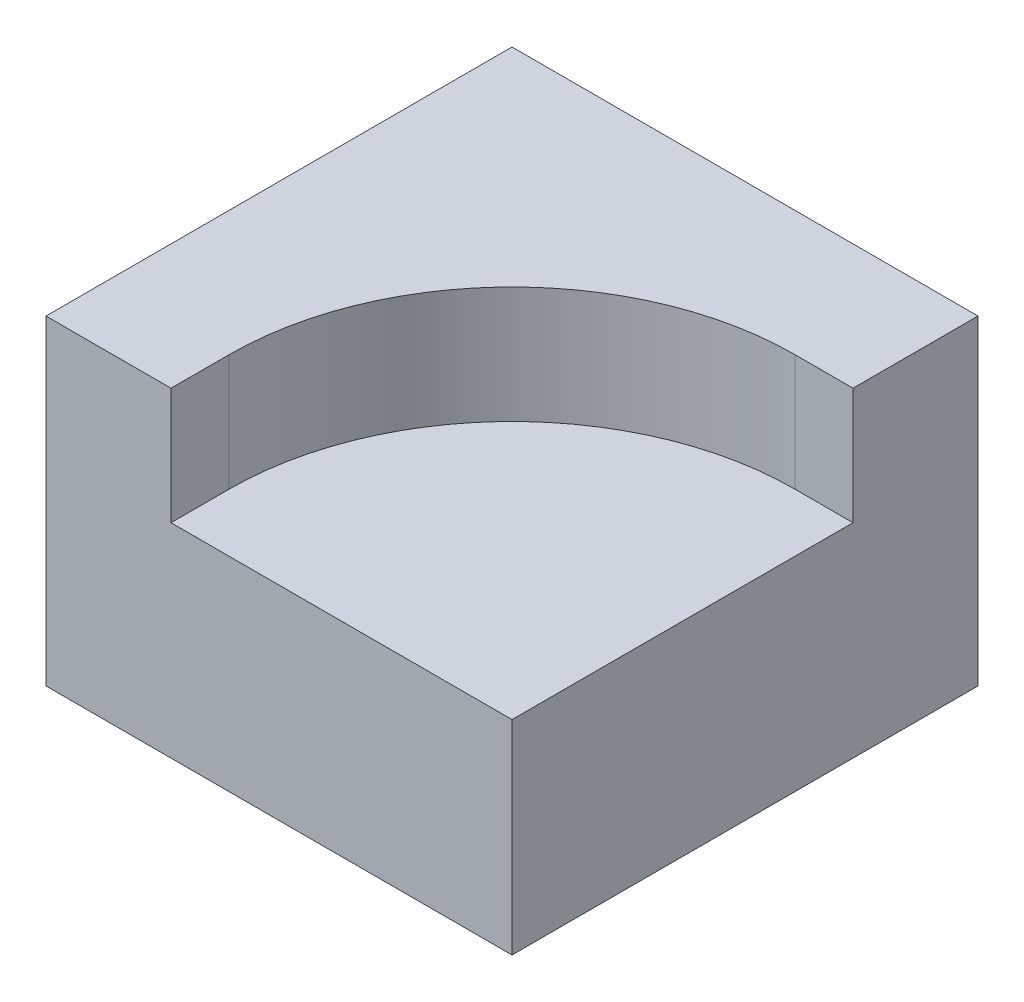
ISO-10303-21;
HEADER;
FILE_DESCRIPTION(('STEP AP214'),'2;1');
FILE_NAME('part.step','',(''),(''),'','','');
FILE_SCHEMA(('AUTOMOTIVE_DESIGN { 1 0 10303 214 1 1 1 1 }'));
ENDSEC;
DATA;
#1=APPLICATION_CONTEXT('core data for automotive mechanical design processes');
#2=APPLICATION_PROTOCOL_DEFINITION('international standard','automotive_design',2000,#1);
#3=PRODUCT_CONTEXT('',#1,'mechanical');
#4=PRODUCT('Part','Part','',(#3));
#5=PRODUCT_RELATED_PRODUCT_CATEGORY('part','',(#4));
#6=PRODUCT_DEFINITION_FORMATION('','',#4);
#7=PRODUCT_DEFINITION_CONTEXT('part definition',#1,'design');
#8=PRODUCT_DEFINITION('design','',#6,#7);
#9=PRODUCT_DEFINITION_SHAPE('','',#8);
#10=(LENGTH_UNIT() NAMED_UNIT(*) SI_UNIT(.MILLI.,.METRE.));
#11=(NAMED_UNIT(*) PLANE_ANGLE_UNIT() SI_UNIT($,.RADIAN.));
#12=(NAMED_UNIT(*) SI_UNIT($,.STERADIAN.) SOLID_ANGLE_UNIT());
#13=UNCERTAINTY_MEASURE_WITH_UNIT(LENGTH_MEASURE(1.E-05),#10,'distance_accuracy_value','');
#14=(GEOMETRIC_REPRESENTATION_CONTEXT(3) GLOBAL_UNCERTAINTY_ASSIGNED_CONTEXT((#13)) GLOBAL_UNIT_ASSIGNED_CONTEXT((#10,
#11,#12)) REPRESENTATION_CONTEXT('',''));
#15=CARTESIAN_POINT('',(0.,0.,0.));
#16=DIRECTION('',(0.,0.,1.));
#17=DIRECTION('',(1.,0.,0.));
#18=AXIS2_PLACEMENT_3D('',#15,#16,#17);
#19=CARTESIAN_POINT('',(0.,69.85,0.));
#20=DIRECTION('',(1.,0.,0.));
#21=DIRECTION('',(0.,0.,-1.));
#22=AXIS2_PLACEMENT_3D('',#19,#20,#21);
#23=PLANE('',#22);
#24=DIRECTION('',(0.,0.,1.));
#25=VECTOR('',#24,1.);
#26=CARTESIAN_POINT('',(0.,0.,0.));
#27=LINE('',#26,#25);
#28=CARTESIAN_POINT('',(0.,0.,-101.6));
#29=VERTEX_POINT('',#28);
#30=CARTESIAN_POINT('',(0.,0.,0.));
#31=VERTEX_POINT('',#30);
#32=EDGE_CURVE('E133',#29,#31,#27,.T.);
#33=ORIENTED_EDGE('',*,*,#32,.T.);
#34=DIRECTION('',(0.,-1.,0.));
#35=VECTOR('',#34,1.);
#36=CARTESIAN_POINT('',(0.,69.85,0.));
#37=LINE('',#36,#35);
#38=CARTESIAN_POINT('',(0.,69.85,0.));
#39=VERTEX_POINT('',#38);
#40=EDGE_CURVE('E11',#39,#31,#37,.T.);
#41=ORIENTED_EDGE('',*,*,#40,.F.);
#42=DIRECTION('',(0.,0.,1.));
#43=VECTOR('',#42,1.);
#44=CARTESIAN_POINT('',(0.,69.85,0.));
#45=LINE('',#44,#43);
#46=CARTESIAN_POINT('',(0.,69.85,-101.6));
#47=VERTEX_POINT('',#46);
#48=EDGE_CURVE('E145',#47,#39,#45,.T.);
#49=ORIENTED_EDGE('',*,*,#48,.F.);
#50=DIRECTION('',(0.,-1.,0.));
#51=VECTOR('',#50,1.);
#52=CARTESIAN_POINT('',(0.,69.85,-101.6));
#53=LINE('',#52,#51);
#54=EDGE_CURVE('E152',#47,#29,#53,.T.);
#55=ORIENTED_EDGE('',*,*,#54,.T.);
#56=EDGE_LOOP('',(#33,#41,#49,#55));
#57=FACE_BOUND('',#56,.T.);
#58=ADVANCED_FACE('F33',(#57),#23,.F.);
#59=CARTESIAN_POINT('',(0.,69.85,0.));
#60=DIRECTION('',(0.,0.,-1.));
#61=DIRECTION('',(-1.,0.,0.));
#62=AXIS2_PLACEMENT_3D('',#59,#60,#61);
#63=PLANE('',#62);
#64=DIRECTION('',(1.,0.,0.));
#65=VECTOR('',#64,1.);
#66=CARTESIAN_POINT('',(101.6,44.45,0.));
#67=LINE('',#66,#65);
#68=CARTESIAN_POINT('',(27.2531892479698,44.45,0.));
#69=VERTEX_POINT('',#68);
#70=CARTESIAN_POINT('',(101.6,44.45,0.));
#71=VERTEX_POINT('',#70);
#72=EDGE_CURVE('E128',#69,#71,#67,.T.);
#73=ORIENTED_EDGE('',*,*,#72,.F.);
#74=DIRECTION('',(0.,1.,0.));
#75=VECTOR('',#74,1.);
#76=CARTESIAN_POINT('',(27.2531892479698,44.45,0.));
#77=LINE('',#76,#75);
#78=CARTESIAN_POINT('',(27.2531892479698,69.85,0.));
#79=VERTEX_POINT('',#78);
#80=EDGE_CURVE('E130',#69,#79,#77,.T.);
#81=ORIENTED_EDGE('',*,*,#80,.T.);
#82=DIRECTION('',(1.,0.,0.));
#83=VECTOR('',#82,1.);
#84=CARTESIAN_POINT('',(0.,69.85,0.));
#85=LINE('',#84,#83);
#86=EDGE_CURVE('E147',#39,#79,#85,.T.);
#87=ORIENTED_EDGE('',*,*,#86,.F.);
#88=ORIENTED_EDGE('',*,*,#40,.T.);
#89=DIRECTION('',(1.,0.,0.));
#90=VECTOR('',#89,1.);
#91=CARTESIAN_POINT('',(0.,0.,0.));
#92=LINE('',#91,#90);
#93=CARTESIAN_POINT('',(101.6,0.,0.));
#94=VERTEX_POINT('',#93);
#95=EDGE_CURVE('E138',#31,#94,#92,.T.);
#96=ORIENTED_EDGE('',*,*,#95,.T.);
#97=DIRECTION('',(0.,-1.,0.));
#98=VECTOR('',#97,1.);
#99=CARTESIAN_POINT('',(101.6,69.85,0.));
#100=LINE('',#99,#98);
#101=EDGE_CURVE('E40',#71,#94,#100,.T.);
#102=ORIENTED_EDGE('',*,*,#101,.F.);
#103=EDGE_LOOP('',(#73,#81,#87,#88,#96,#102));
#104=FACE_BOUND('',#103,.T.);
#105=ADVANCED_FACE('F165',(#104),#63,.F.);
#106=CARTESIAN_POINT('',(101.6,69.85,0.));
#107=DIRECTION('',(-1.,0.,0.));
#108=DIRECTION('',(0.,0.,1.));
#109=AXIS2_PLACEMENT_3D('',#106,#107,#108);
#110=PLANE('',#109);
#111=DIRECTION('',(0.,0.,-1.));
#112=VECTOR('',#111,1.);
#113=CARTESIAN_POINT('',(101.6,69.85,0.));
#114=LINE('',#113,#112);
#115=CARTESIAN_POINT('',(101.6,69.85,-74.3521335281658));
#116=VERTEX_POINT('',#115);
#117=CARTESIAN_POINT('',(101.6,69.85,-101.6));
#118=VERTEX_POINT('',#117);
#119=EDGE_CURVE('E149',#116,#118,#114,.T.);
#120=ORIENTED_EDGE('',*,*,#119,.F.);
#121=DIRECTION('',(0.,1.,0.));
#122=VECTOR('',#121,1.);
#123=CARTESIAN_POINT('',(101.6,44.45,-74.3521335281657));
#124=LINE('',#123,#122);
#125=CARTESIAN_POINT('',(101.6,44.45,-74.3521335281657));
#126=VERTEX_POINT('',#125);
#127=EDGE_CURVE('E47',#126,#116,#124,.T.);
#128=ORIENTED_EDGE('',*,*,#127,.F.);
#129=DIRECTION('',(0.,0.,-1.));
#130=VECTOR('',#129,1.);
#131=CARTESIAN_POINT('',(101.6,44.45,-74.3521335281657));
#132=LINE('',#131,#130);
#133=EDGE_CURVE('E117',#71,#126,#132,.T.);
#134=ORIENTED_EDGE('',*,*,#133,.F.);
#135=ORIENTED_EDGE('',*,*,#101,.T.);
#136=DIRECTION('',(0.,0.,-1.));
#137=VECTOR('',#136,1.);
#138=CARTESIAN_POINT('',(101.6,0.,0.));
#139=LINE('',#138,#137);
#140=CARTESIAN_POINT('',(101.6,0.,-101.6));
#141=VERTEX_POINT('',#140);
#142=EDGE_CURVE('E141',#94,#141,#139,.T.);
#143=ORIENTED_EDGE('',*,*,#142,.T.);
#144=DIRECTION('',(0.,-1.,0.));
#145=VECTOR('',#144,1.);
#146=CARTESIAN_POINT('',(101.6,69.85,-101.6));
#147=LINE('',#146,#145);
#148=EDGE_CURVE('E155',#118,#141,#147,.T.);
#149=ORIENTED_EDGE('',*,*,#148,.F.);
#150=EDGE_LOOP('',(#120,#128,#134,#135,#143,#149));
#151=FACE_BOUND('',#150,.T.);
#152=ADVANCED_FACE('F160',(#151),#110,.F.);
#153=CARTESIAN_POINT('',(0.,69.85,-101.6));
#154=DIRECTION('',(0.,0.,1.));
#155=DIRECTION('',(1.,0.,0.));
#156=AXIS2_PLACEMENT_3D('',#153,#154,#155);
#157=PLANE('',#156);
#158=DIRECTION('',(-1.,0.,0.));
#159=VECTOR('',#158,1.);
#160=CARTESIAN_POINT('',(0.,0.,-101.6));
#161=LINE('',#160,#159);
#162=EDGE_CURVE('E143',#141,#29,#161,.T.);
#163=ORIENTED_EDGE('',*,*,#162,.T.);
#164=ORIENTED_EDGE('',*,*,#54,.F.);
#165=DIRECTION('',(-1.,0.,0.));
#166=VECTOR('',#165,1.);
#167=CARTESIAN_POINT('',(0.,69.85,-101.6));
#168=LINE('',#167,#166);
#169=EDGE_CURVE('E55',#118,#47,#168,.T.);
#170=ORIENTED_EDGE('',*,*,#169,.F.);
#171=ORIENTED_EDGE('',*,*,#148,.T.);
#172=EDGE_LOOP('',(#163,#164,#170,#171));
#173=FACE_BOUND('',#172,.T.);
#174=ADVANCED_FACE('F172',(#173),#157,.F.);
#175=CARTESIAN_POINT('',(0.,69.85,-101.6));
#176=DIRECTION('',(0.,-1.,0.));
#177=DIRECTION('',(0.,0.,-1.));
#178=AXIS2_PLACEMENT_3D('',#175,#176,#177);
#179=PLANE('',#178);
#180=ORIENTED_EDGE('',*,*,#86,.T.);
#181=DIRECTION('',(0.,0.,1.));
#182=VECTOR('',#181,1.);
#183=CARTESIAN_POINT('',(27.2531892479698,69.85,-12.7));
#184=LINE('',#183,#182);
#185=CARTESIAN_POINT('',(27.2531892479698,69.85,-12.7));
#186=VERTEX_POINT('',#185);
#187=EDGE_CURVE('E115',#186,#79,#184,.T.);
#188=ORIENTED_EDGE('',*,*,#187,.F.);
#189=CARTESIAN_POINT('',(88.9053227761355,69.85,-12.7));
#190=DIRECTION('',(0.,1.,0.));
#191=DIRECTION('',(0.,0.,1.));
#192=AXIS2_PLACEMENT_3D('',#189,#190,#191);
#193=CIRCLE('',#192,61.6521335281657);
#194=CARTESIAN_POINT('',(88.9053227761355,69.85,-74.3521335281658));
#195=VERTEX_POINT('',#194);
#196=EDGE_CURVE('E102',#195,#186,#193,.T.);
#197=ORIENTED_EDGE('',*,*,#196,.F.);
#198=DIRECTION('',(-1.,0.,0.));
#199=VECTOR('',#198,1.);
#200=CARTESIAN_POINT('',(101.6,69.85,-74.3521335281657));
#201=LINE('',#200,#199);
#202=EDGE_CURVE('E109',#116,#195,#201,.T.);
#203=ORIENTED_EDGE('',*,*,#202,.F.);
#204=ORIENTED_EDGE('',*,*,#119,.T.);
#205=ORIENTED_EDGE('',*,*,#169,.T.);
#206=ORIENTED_EDGE('',*,*,#48,.T.);
#207=EDGE_LOOP('',(#180,#188,#197,#203,#204,#205,#206));
#208=FACE_BOUND('',#207,.T.);
#209=ADVANCED_FACE('F114',(#208),#179,.F.);
#210=CARTESIAN_POINT('',(0.,0.,-101.6));
#211=DIRECTION('',(0.,-1.,0.));
#212=DIRECTION('',(0.,0.,-1.));
#213=AXIS2_PLACEMENT_3D('',#210,#211,#212);
#214=PLANE('',#213);
#215=ORIENTED_EDGE('',*,*,#32,.F.);
#216=ORIENTED_EDGE('',*,*,#162,.F.);
#217=ORIENTED_EDGE('',*,*,#142,.F.);
#218=ORIENTED_EDGE('',*,*,#95,.F.);
#219=EDGE_LOOP('',(#215,#216,#217,#218));
#220=FACE_BOUND('',#219,.T.);
#221=ADVANCED_FACE('F170',(#220),#214,.T.);
#222=CARTESIAN_POINT('',(27.2531892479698,44.45,-12.7));
#223=DIRECTION('',(-1.,0.,0.));
#224=DIRECTION('',(0.,0.,1.));
#225=AXIS2_PLACEMENT_3D('',#222,#223,#224);
#226=PLANE('',#225);
#227=ORIENTED_EDGE('',*,*,#187,.T.);
#228=ORIENTED_EDGE('',*,*,#80,.F.);
#229=DIRECTION('',(0.,0.,1.));
#230=VECTOR('',#229,1.);
#231=CARTESIAN_POINT('',(27.2531892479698,44.45,-12.7));
#232=LINE('',#231,#230);
#233=CARTESIAN_POINT('',(27.2531892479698,44.45,-12.7));
#234=VERTEX_POINT('',#233);
#235=EDGE_CURVE('E125',#234,#69,#232,.T.);
#236=ORIENTED_EDGE('',*,*,#235,.F.);
#237=DIRECTION('',(0.,1.,0.));
#238=VECTOR('',#237,1.);
#239=CARTESIAN_POINT('',(27.2531892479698,44.45,-12.7));
#240=LINE('',#239,#238);
#241=EDGE_CURVE('E107',#234,#186,#240,.T.);
#242=ORIENTED_EDGE('',*,*,#241,.T.);
#243=EDGE_LOOP('',(#227,#228,#236,#242));
#244=FACE_BOUND('',#243,.T.);
#245=ADVANCED_FACE('F177',(#244),#226,.F.);
#246=CARTESIAN_POINT('',(88.9053227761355,44.45,-12.7));
#247=DIRECTION('',(0.,1.,0.));
#248=DIRECTION('',(0.,0.,1.));
#249=AXIS2_PLACEMENT_3D('',#246,#247,#248);
#250=CYLINDRICAL_SURFACE('',#249,61.6521335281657);
#251=ORIENTED_EDGE('',*,*,#196,.T.);
#252=ORIENTED_EDGE('',*,*,#241,.F.);
#253=CARTESIAN_POINT('',(88.9053227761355,44.45,-12.7));
#254=DIRECTION('',(0.,1.,0.));
#255=DIRECTION('',(0.,0.,1.));
#256=AXIS2_PLACEMENT_3D('',#253,#254,#255);
#257=CIRCLE('',#256,61.6521335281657);
#258=CARTESIAN_POINT('',(88.9053227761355,44.45,-74.3521335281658));
#259=VERTEX_POINT('',#258);
#260=EDGE_CURVE('E105',#259,#234,#257,.T.);
#261=ORIENTED_EDGE('',*,*,#260,.F.);
#262=DIRECTION('',(0.,1.,0.));
#263=VECTOR('',#262,1.);
#264=CARTESIAN_POINT('',(88.9053227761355,44.45,-74.3521335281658));
#265=LINE('',#264,#263);
#266=EDGE_CURVE('E99',#259,#195,#265,.T.);
#267=ORIENTED_EDGE('',*,*,#266,.T.);
#268=EDGE_LOOP('',(#251,#252,#261,#267));
#269=FACE_BOUND('',#268,.T.);
#270=ADVANCED_FACE('F100',(#269),#250,.F.);
#271=CARTESIAN_POINT('',(101.6,44.45,-74.3521335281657));
#272=DIRECTION('',(0.,0.,-1.));
#273=DIRECTION('',(-1.,0.,0.));
#274=AXIS2_PLACEMENT_3D('',#271,#272,#273);
#275=PLANE('',#274);
#276=ORIENTED_EDGE('',*,*,#202,.T.);
#277=ORIENTED_EDGE('',*,*,#266,.F.);
#278=DIRECTION('',(-1.,0.,0.));
#279=VECTOR('',#278,1.);
#280=CARTESIAN_POINT('',(101.6,44.45,-74.3521335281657));
#281=LINE('',#280,#279);
#282=EDGE_CURVE('E122',#126,#259,#281,.T.);
#283=ORIENTED_EDGE('',*,*,#282,.F.);
#284=ORIENTED_EDGE('',*,*,#127,.T.);
#285=EDGE_LOOP('',(#276,#277,#283,#284));
#286=FACE_BOUND('',#285,.T.);
#287=ADVANCED_FACE('F110',(#286),#275,.F.);
#288=CARTESIAN_POINT('',(88.9053227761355,44.45,-12.7));
#289=DIRECTION('',(0.,1.,0.));
#290=DIRECTION('',(0.,0.,1.));
#291=AXIS2_PLACEMENT_3D('',#288,#289,#290);
#292=PLANE('',#291);
#293=ORIENTED_EDGE('',*,*,#133,.T.);
#294=ORIENTED_EDGE('',*,*,#282,.T.);
#295=ORIENTED_EDGE('',*,*,#260,.T.);
#296=ORIENTED_EDGE('',*,*,#235,.T.);
#297=ORIENTED_EDGE('',*,*,#72,.T.);
#298=EDGE_LOOP('',(#293,#294,#295,#296,#297));
#299=FACE_BOUND('',#298,.T.);
#300=ADVANCED_FACE('F179',(#299),#292,.T.);
#301=CLOSED_SHELL('',(#58,#105,#152,#174,#209,#221,#245,#270,#287,#300));
#302=MANIFOLD_SOLID_BREP('B2',#301);
#303=ADVANCED_BREP_SHAPE_REPRESENTATION('',(#18,#302),#14);
#304=SHAPE_DEFINITION_REPRESENTATION(#9,#303);
ENDSEC;
END-ISO-10303-21;
